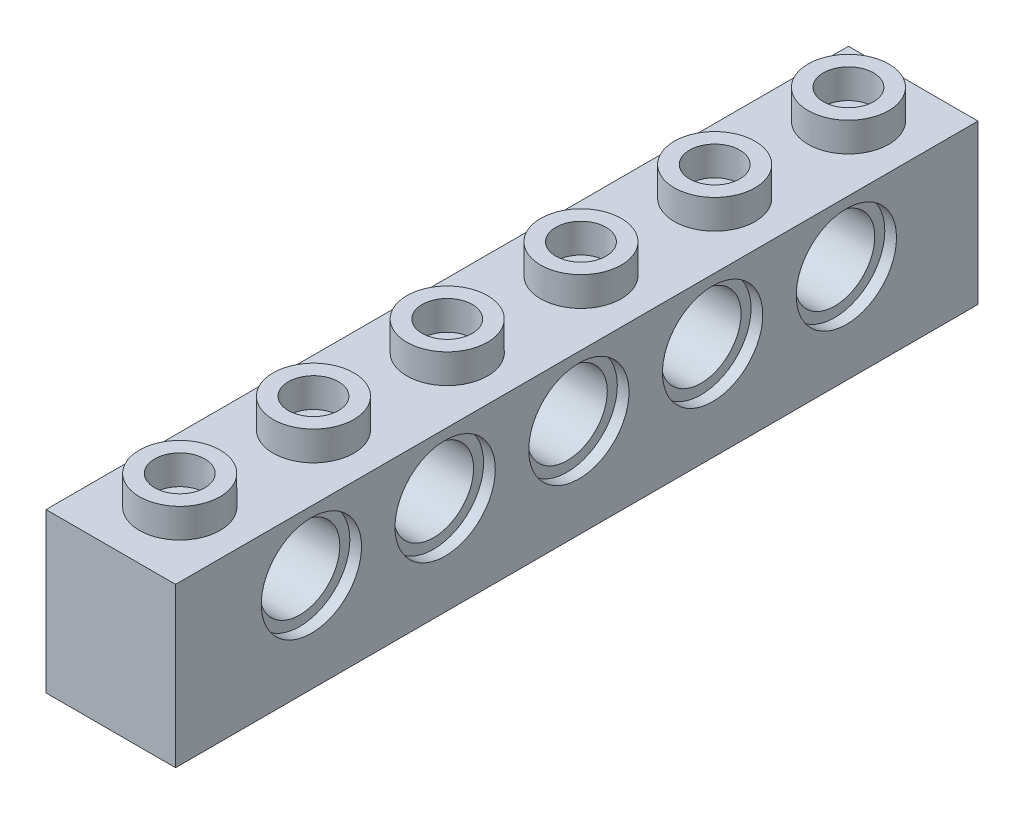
from build123d import *

# Parameters (mm, degrees)
SKETCH1_W           = 7.75
SKETCH1_H           = 9.5
BOSS_EXTRUDE1_DEPTH = 48
SKETCH2_R           = 2.415
SKETCH2_R_2         = 1.5
BOSS_EXTRUDE2_DEPTH = 1.75
LPATTERN1_COUNT     = 6
LPATTERN1_PITCH     = 8
SKETCH5_W           = 4.85
SKETCH5_H           = 45.1
CUT_EXTRUDE1_DEPTH  = 1.75
SKETCH6_R           = 1.5
BOSS_EXTRUDE3_DEPTH = 1.75
LPATTERN2_COUNT     = 5
LPATTERN2_PITCH     = 8
SKETCH7_R           = 3
CUT_EXTRUDE2_DEPTH  = 0.7
CUT_EXTRUDE4_START  = -0.7
SKETCH8_R           = 3
CUT_EXTRUDE4_DEPTH  = 0.7
SKETCH9_R           = 2.4
CUT_EXTRUDE5_DEPTH  = 49.9484678
LPATTERN3_COUNT     = 5
LPATTERN3_PITCH     = 8


with BuildPart() as part:
    # Sketch1 → Boss-Extrude1 (new body)
    with BuildSketch(Plane.XY):
        Rectangle(SKETCH1_W, SKETCH1_H)
    extrude(amount=BOSS_EXTRUDE1_DEPTH)

    # Sketch2 → Boss-Extrude2 (add)
    with BuildSketch(Plane(origin=(0, 4.75, 0), x_dir=(-1, 0, 0), z_dir=(0, 1, 0))):
        with Locations(Location((0, 3.875, 0), (0, 0, 180))):
            Circle(SKETCH2_R)
        with Locations((0, 3.875)):
            Circle(SKETCH2_R_2, mode=Mode.SUBTRACT)
    boss_extrude2 = extrude(amount=BOSS_EXTRUDE2_DEPTH)

    # LPattern1: Boss-Extrude2 ×6
    with Locations(*[(0, 0, i * LPATTERN1_PITCH) for i in range(1, LPATTERN1_COUNT)]):
        add(boss_extrude2)

    # Sketch5 → Cut-Extrude1 (cut)
    with BuildSketch(Plane.XZ.offset(4.75)):
        with Locations((0, 24)):
            Rectangle(SKETCH5_W, SKETCH5_H)
    extrude(amount=-CUT_EXTRUDE1_DEPTH, mode=Mode.SUBTRACT)

    # Sketch6 → Boss-Extrude3 (add)
    with BuildSketch(Plane.XZ.offset(3)):
        with Locations(Location((0, 40.4, 0), (0, 0, 270))):
            Circle(SKETCH6_R)
    boss_extrude3 = extrude(amount=BOSS_EXTRUDE3_DEPTH)

    # LPattern2: Boss-Extrude3 ×5
    with Locations(*[(0, 0, -i * LPATTERN2_PITCH) for i in range(1, LPATTERN2_COUNT)]):
        add(boss_extrude3)

    # Sketch7 → Cut-Extrude2 (cut)
    with BuildSketch(Plane.ZY.offset(3.875)):
        with Locations((39.875, 1.15)):
            Circle(SKETCH7_R)
    cut_extrude2 = extrude(amount=-CUT_EXTRUDE2_DEPTH, mode=Mode.SUBTRACT)

    # Sketch8 → Cut-Extrude4 (cut)
    with BuildSketch(Plane(origin=(3.875, 0, 0), x_dir=(0, 0, -1), z_dir=(1, 0, 0)).offset(CUT_EXTRUDE4_START)):
        with Locations(Location((-39.875, 1.15, 0), (0, 0, 180))):
            Circle(SKETCH8_R)
    cut_extrude4 = extrude(amount=CUT_EXTRUDE4_DEPTH, mode=Mode.SUBTRACT)

    # Sketch9 → Cut-Extrude5 (cut, through all)
    with BuildSketch(Plane.ZY.offset(3.175)):
        with Locations((39.875, 1.15)):
            Circle(SKETCH9_R)
    cut_extrude5 = extrude(amount=-CUT_EXTRUDE5_DEPTH, mode=Mode.SUBTRACT)

    # LPattern3: Cut-Extrude2, Cut-Extrude4, Cut-Extrude5 ×5
    with Locations(*[(0, 0, -i * LPATTERN3_PITCH) for i in range(1, LPATTERN3_COUNT)]):
        add(cut_extrude2, mode=Mode.SUBTRACT)
        add(cut_extrude4, mode=Mode.SUBTRACT)
        add(cut_extrude5, mode=Mode.SUBTRACT)


solid = part.part
